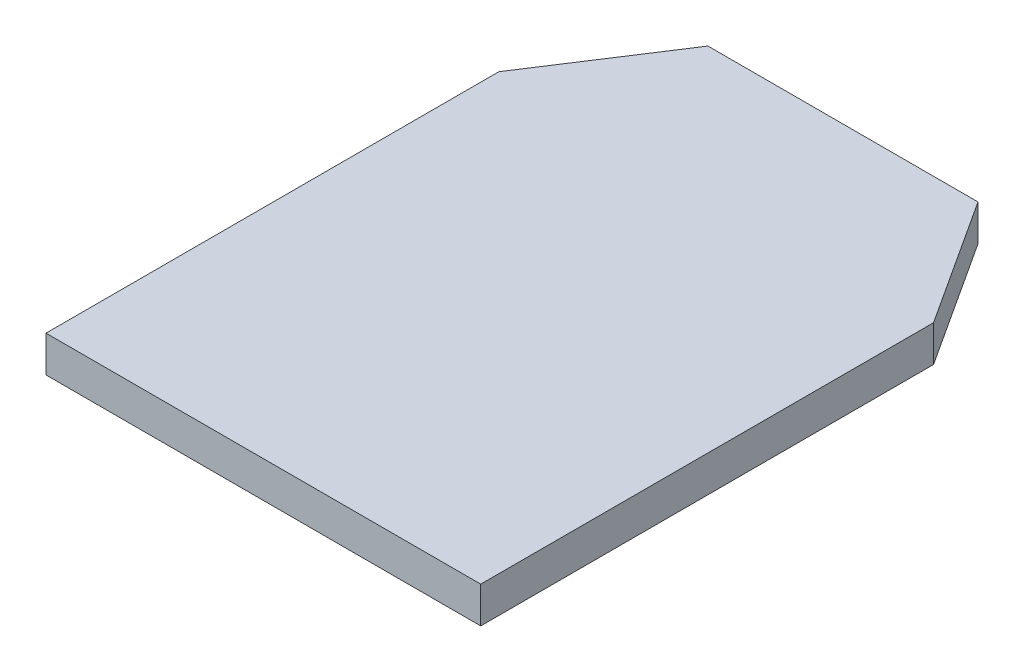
ISO-10303-21;
HEADER;
FILE_DESCRIPTION(('STEP AP214'),'2;1');
FILE_NAME('part.step','',(''),(''),'','','');
FILE_SCHEMA(('AUTOMOTIVE_DESIGN { 1 0 10303 214 1 1 1 1 }'));
ENDSEC;
DATA;
#1=APPLICATION_CONTEXT('core data for automotive mechanical design processes');
#2=APPLICATION_PROTOCOL_DEFINITION('international standard','automotive_design',2000,#1);
#3=PRODUCT_CONTEXT('',#1,'mechanical');
#4=PRODUCT('Part','Part','',(#3));
#5=PRODUCT_RELATED_PRODUCT_CATEGORY('part','',(#4));
#6=PRODUCT_DEFINITION_FORMATION('','',#4);
#7=PRODUCT_DEFINITION_CONTEXT('part definition',#1,'design');
#8=PRODUCT_DEFINITION('design','',#6,#7);
#9=PRODUCT_DEFINITION_SHAPE('','',#8);
#10=(LENGTH_UNIT() NAMED_UNIT(*) SI_UNIT(.MILLI.,.METRE.));
#11=(NAMED_UNIT(*) PLANE_ANGLE_UNIT() SI_UNIT($,.RADIAN.));
#12=(NAMED_UNIT(*) SI_UNIT($,.STERADIAN.) SOLID_ANGLE_UNIT());
#13=UNCERTAINTY_MEASURE_WITH_UNIT(LENGTH_MEASURE(1.E-05),#10,'distance_accuracy_value','');
#14=(GEOMETRIC_REPRESENTATION_CONTEXT(3) GLOBAL_UNCERTAINTY_ASSIGNED_CONTEXT((#13)) GLOBAL_UNIT_ASSIGNED_CONTEXT((#10,
#11,#12)) REPRESENTATION_CONTEXT('',''));
#15=CARTESIAN_POINT('',(0.,0.,0.));
#16=DIRECTION('',(0.,0.,1.));
#17=DIRECTION('',(1.,0.,0.));
#18=AXIS2_PLACEMENT_3D('',#15,#16,#17);
#19=CARTESIAN_POINT('',(37.270734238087,10.,-45.));
#20=DIRECTION('',(-0.838670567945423,0.,0.544639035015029));
#21=DIRECTION('',(0.544639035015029,0.,0.838670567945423));
#22=AXIS2_PLACEMENT_3D('',#19,#20,#21);
#23=PLANE('',#22);
#24=DIRECTION('',(-0.544639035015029,0.,-0.838670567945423));
#25=VECTOR('',#24,1.);
#26=CARTESIAN_POINT('',(37.270734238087,0.,-45.));
#27=LINE('',#26,#25);
#28=CARTESIAN_POINT('',(60.,0.,-9.99999999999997));
#29=VERTEX_POINT('',#28);
#30=CARTESIAN_POINT('',(37.270734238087,0.,-45.));
#31=VERTEX_POINT('',#30);
#32=EDGE_CURVE('E115',#29,#31,#27,.T.);
#33=ORIENTED_EDGE('',*,*,#32,.T.);
#34=DIRECTION('',(0.,-1.,0.));
#35=VECTOR('',#34,1.);
#36=CARTESIAN_POINT('',(37.270734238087,10.,-45.));
#37=LINE('',#36,#35);
#38=CARTESIAN_POINT('',(37.270734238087,10.,-45.));
#39=VERTEX_POINT('',#38);
#40=EDGE_CURVE('E11',#39,#31,#37,.T.);
#41=ORIENTED_EDGE('',*,*,#40,.F.);
#42=DIRECTION('',(-0.544639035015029,0.,-0.838670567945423));
#43=VECTOR('',#42,1.);
#44=CARTESIAN_POINT('',(37.270734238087,10.,-45.));
#45=LINE('',#44,#43);
#46=CARTESIAN_POINT('',(60.,10.,-9.99999999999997));
#47=VERTEX_POINT('',#46);
#48=EDGE_CURVE('E125',#47,#39,#45,.T.);
#49=ORIENTED_EDGE('',*,*,#48,.F.);
#50=DIRECTION('',(0.,-1.,0.));
#51=VECTOR('',#50,1.);
#52=CARTESIAN_POINT('',(60.,10.,-9.99999999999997));
#53=LINE('',#52,#51);
#54=EDGE_CURVE('E111',#47,#29,#53,.T.);
#55=ORIENTED_EDGE('',*,*,#54,.T.);
#56=EDGE_LOOP('',(#33,#41,#49,#55));
#57=FACE_BOUND('',#56,.T.);
#58=ADVANCED_FACE('F31',(#57),#23,.F.);
#59=CARTESIAN_POINT('',(-37.270734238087,10.,-45.));
#60=DIRECTION('',(0.,0.,1.));
#61=DIRECTION('',(1.,0.,0.));
#62=AXIS2_PLACEMENT_3D('',#59,#60,#61);
#63=PLANE('',#62);
#64=DIRECTION('',(-1.,0.,0.));
#65=VECTOR('',#64,1.);
#66=CARTESIAN_POINT('',(-37.270734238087,0.,-45.));
#67=LINE('',#66,#65);
#68=CARTESIAN_POINT('',(-37.270734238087,0.,-45.));
#69=VERTEX_POINT('',#68);
#70=EDGE_CURVE('E118',#31,#69,#67,.T.);
#71=ORIENTED_EDGE('',*,*,#70,.T.);
#72=DIRECTION('',(0.,-1.,0.));
#73=VECTOR('',#72,1.);
#74=CARTESIAN_POINT('',(-37.270734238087,10.,-45.));
#75=LINE('',#74,#73);
#76=CARTESIAN_POINT('',(-37.270734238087,10.,-45.));
#77=VERTEX_POINT('',#76);
#78=EDGE_CURVE('E39',#77,#69,#75,.T.);
#79=ORIENTED_EDGE('',*,*,#78,.F.);
#80=DIRECTION('',(-1.,0.,0.));
#81=VECTOR('',#80,1.);
#82=CARTESIAN_POINT('',(-37.270734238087,10.,-45.));
#83=LINE('',#82,#81);
#84=EDGE_CURVE('E84',#39,#77,#83,.T.);
#85=ORIENTED_EDGE('',*,*,#84,.F.);
#86=ORIENTED_EDGE('',*,*,#40,.T.);
#87=EDGE_LOOP('',(#71,#79,#85,#86));
#88=FACE_BOUND('',#87,.T.);
#89=ADVANCED_FACE('F149',(#88),#63,.F.);
#90=CARTESIAN_POINT('',(-37.270734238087,10.,-45.));
#91=DIRECTION('',(0.838670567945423,0.,0.544639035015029));
#92=DIRECTION('',(0.544639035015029,0.,-0.838670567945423));
#93=AXIS2_PLACEMENT_3D('',#90,#91,#92);
#94=PLANE('',#93);
#95=DIRECTION('',(-0.544639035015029,0.,0.838670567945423));
#96=VECTOR('',#95,1.);
#97=CARTESIAN_POINT('',(-37.270734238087,0.,-45.));
#98=LINE('',#97,#96);
#99=CARTESIAN_POINT('',(-60.,0.,-9.99999999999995));
#100=VERTEX_POINT('',#99);
#101=EDGE_CURVE('E120',#69,#100,#98,.T.);
#102=ORIENTED_EDGE('',*,*,#101,.T.);
#103=DIRECTION('',(0.,-1.,0.));
#104=VECTOR('',#103,1.);
#105=CARTESIAN_POINT('',(-60.,10.,-9.99999999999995));
#106=LINE('',#105,#104);
#107=CARTESIAN_POINT('',(-60.,10.,-9.99999999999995));
#108=VERTEX_POINT('',#107);
#109=EDGE_CURVE('E106',#108,#100,#106,.T.);
#110=ORIENTED_EDGE('',*,*,#109,.F.);
#111=DIRECTION('',(-0.544639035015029,0.,0.838670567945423));
#112=VECTOR('',#111,1.);
#113=CARTESIAN_POINT('',(-37.270734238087,10.,-45.));
#114=LINE('',#113,#112);
#115=EDGE_CURVE('E97',#77,#108,#114,.T.);
#116=ORIENTED_EDGE('',*,*,#115,.F.);
#117=ORIENTED_EDGE('',*,*,#78,.T.);
#118=EDGE_LOOP('',(#102,#110,#116,#117));
#119=FACE_BOUND('',#118,.T.);
#120=ADVANCED_FACE('F131',(#119),#94,.F.);
#121=CARTESIAN_POINT('',(-60.,10.,-9.99999999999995));
#122=DIRECTION('',(1.,0.,0.));
#123=DIRECTION('',(0.,0.,-1.));
#124=AXIS2_PLACEMENT_3D('',#121,#122,#123);
#125=PLANE('',#124);
#126=DIRECTION('',(0.,0.,1.));
#127=VECTOR('',#126,1.);
#128=CARTESIAN_POINT('',(-60.,0.,-9.99999999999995));
#129=LINE('',#128,#127);
#130=CARTESIAN_POINT('',(-60.,0.,115.));
#131=VERTEX_POINT('',#130);
#132=EDGE_CURVE('E105',#100,#131,#129,.T.);
#133=ORIENTED_EDGE('',*,*,#132,.T.);
#134=DIRECTION('',(0.,-1.,0.));
#135=VECTOR('',#134,1.);
#136=CARTESIAN_POINT('',(-60.,10.,115.));
#137=LINE('',#136,#135);
#138=CARTESIAN_POINT('',(-60.,10.,115.));
#139=VERTEX_POINT('',#138);
#140=EDGE_CURVE('E102',#139,#131,#137,.T.);
#141=ORIENTED_EDGE('',*,*,#140,.F.);
#142=DIRECTION('',(0.,0.,1.));
#143=VECTOR('',#142,1.);
#144=CARTESIAN_POINT('',(-60.,10.,-9.99999999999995));
#145=LINE('',#144,#143);
#146=EDGE_CURVE('E91',#108,#139,#145,.T.);
#147=ORIENTED_EDGE('',*,*,#146,.F.);
#148=ORIENTED_EDGE('',*,*,#109,.T.);
#149=EDGE_LOOP('',(#133,#141,#147,#148));
#150=FACE_BOUND('',#149,.T.);
#151=ADVANCED_FACE('F103',(#150),#125,.F.);
#152=CARTESIAN_POINT('',(60.,10.,115.));
#153=DIRECTION('',(0.,0.,-1.));
#154=DIRECTION('',(-1.,0.,0.));
#155=AXIS2_PLACEMENT_3D('',#152,#153,#154);
#156=PLANE('',#155);
#157=DIRECTION('',(1.,0.,0.));
#158=VECTOR('',#157,1.);
#159=CARTESIAN_POINT('',(60.,0.,115.));
#160=LINE('',#159,#158);
#161=CARTESIAN_POINT('',(60.,0.,115.));
#162=VERTEX_POINT('',#161);
#163=EDGE_CURVE('E70',#131,#162,#160,.T.);
#164=ORIENTED_EDGE('',*,*,#163,.T.);
#165=DIRECTION('',(0.,-1.,0.));
#166=VECTOR('',#165,1.);
#167=CARTESIAN_POINT('',(60.,10.,115.));
#168=LINE('',#167,#166);
#169=CARTESIAN_POINT('',(60.,10.,115.));
#170=VERTEX_POINT('',#169);
#171=EDGE_CURVE('E107',#170,#162,#168,.T.);
#172=ORIENTED_EDGE('',*,*,#171,.F.);
#173=DIRECTION('',(1.,0.,0.));
#174=VECTOR('',#173,1.);
#175=CARTESIAN_POINT('',(60.,10.,115.));
#176=LINE('',#175,#174);
#177=EDGE_CURVE('E95',#139,#170,#176,.T.);
#178=ORIENTED_EDGE('',*,*,#177,.F.);
#179=ORIENTED_EDGE('',*,*,#140,.T.);
#180=EDGE_LOOP('',(#164,#172,#178,#179));
#181=FACE_BOUND('',#180,.T.);
#182=ADVANCED_FACE('F109',(#181),#156,.F.);
#183=CARTESIAN_POINT('',(60.,10.,-9.99999999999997));
#184=DIRECTION('',(-1.,0.,0.));
#185=DIRECTION('',(0.,0.,1.));
#186=AXIS2_PLACEMENT_3D('',#183,#184,#185);
#187=PLANE('',#186);
#188=DIRECTION('',(0.,0.,-1.));
#189=VECTOR('',#188,1.);
#190=CARTESIAN_POINT('',(60.,0.,-9.99999999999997));
#191=LINE('',#190,#189);
#192=EDGE_CURVE('E76',#162,#29,#191,.T.);
#193=ORIENTED_EDGE('',*,*,#192,.T.);
#194=ORIENTED_EDGE('',*,*,#54,.F.);
#195=DIRECTION('',(0.,0.,-1.));
#196=VECTOR('',#195,1.);
#197=CARTESIAN_POINT('',(60.,10.,-9.99999999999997));
#198=LINE('',#197,#196);
#199=EDGE_CURVE('E47',#170,#47,#198,.T.);
#200=ORIENTED_EDGE('',*,*,#199,.F.);
#201=ORIENTED_EDGE('',*,*,#171,.T.);
#202=EDGE_LOOP('',(#193,#194,#200,#201));
#203=FACE_BOUND('',#202,.T.);
#204=ADVANCED_FACE('F138',(#203),#187,.F.);
#205=CARTESIAN_POINT('',(0.,10.,-102.391897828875));
#206=DIRECTION('',(0.,-1.,0.));
#207=DIRECTION('',(0.,0.,-1.));
#208=AXIS2_PLACEMENT_3D('',#205,#206,#207);
#209=PLANE('',#208);
#210=ORIENTED_EDGE('',*,*,#48,.T.);
#211=ORIENTED_EDGE('',*,*,#84,.T.);
#212=ORIENTED_EDGE('',*,*,#115,.T.);
#213=ORIENTED_EDGE('',*,*,#146,.T.);
#214=ORIENTED_EDGE('',*,*,#177,.T.);
#215=ORIENTED_EDGE('',*,*,#199,.T.);
#216=EDGE_LOOP('',(#210,#211,#212,#213,#214,#215));
#217=FACE_BOUND('',#216,.T.);
#218=ADVANCED_FACE('F93',(#217),#209,.F.);
#219=CARTESIAN_POINT('',(0.,0.,-102.391897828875));
#220=DIRECTION('',(0.,-1.,0.));
#221=DIRECTION('',(0.,0.,-1.));
#222=AXIS2_PLACEMENT_3D('',#219,#220,#221);
#223=PLANE('',#222);
#224=ORIENTED_EDGE('',*,*,#32,.F.);
#225=ORIENTED_EDGE('',*,*,#192,.F.);
#226=ORIENTED_EDGE('',*,*,#163,.F.);
#227=ORIENTED_EDGE('',*,*,#132,.F.);
#228=ORIENTED_EDGE('',*,*,#101,.F.);
#229=ORIENTED_EDGE('',*,*,#70,.F.);
#230=EDGE_LOOP('',(#224,#225,#226,#227,#228,#229));
#231=FACE_BOUND('',#230,.T.);
#232=ADVANCED_FACE('F134',(#231),#223,.T.);
#233=CLOSED_SHELL('',(#58,#89,#120,#151,#182,#204,#218,#232));
#234=MANIFOLD_SOLID_BREP('B2',#233);
#235=ADVANCED_BREP_SHAPE_REPRESENTATION('',(#18,#234),#14);
#236=SHAPE_DEFINITION_REPRESENTATION(#9,#235);
ENDSEC;
END-ISO-10303-21;
